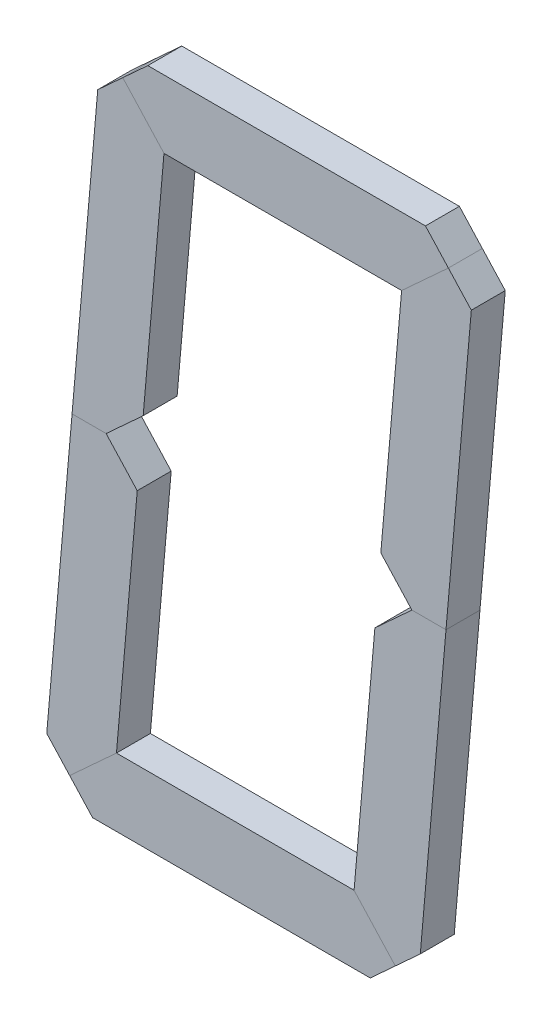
ISO-10303-21;
HEADER;
FILE_DESCRIPTION(('STEP AP214'),'2;1');
FILE_NAME('part.step','',(''),(''),'','','');
FILE_SCHEMA(('AUTOMOTIVE_DESIGN { 1 0 10303 214 1 1 1 1 }'));
ENDSEC;
DATA;
#1=APPLICATION_CONTEXT('core data for automotive mechanical design processes');
#2=APPLICATION_PROTOCOL_DEFINITION('international standard','automotive_design',2000,#1);
#3=PRODUCT_CONTEXT('',#1,'mechanical');
#4=PRODUCT('Part','Part','',(#3));
#5=PRODUCT_RELATED_PRODUCT_CATEGORY('part','',(#4));
#6=PRODUCT_DEFINITION_FORMATION('','',#4);
#7=PRODUCT_DEFINITION_CONTEXT('part definition',#1,'design');
#8=PRODUCT_DEFINITION('design','',#6,#7);
#9=PRODUCT_DEFINITION_SHAPE('','',#8);
#10=(LENGTH_UNIT() NAMED_UNIT(*) SI_UNIT(.MILLI.,.METRE.));
#11=(NAMED_UNIT(*) PLANE_ANGLE_UNIT() SI_UNIT($,.RADIAN.));
#12=(NAMED_UNIT(*) SI_UNIT($,.STERADIAN.) SOLID_ANGLE_UNIT());
#13=UNCERTAINTY_MEASURE_WITH_UNIT(LENGTH_MEASURE(1.E-05),#10,'distance_accuracy_value','');
#14=(GEOMETRIC_REPRESENTATION_CONTEXT(3) GLOBAL_UNCERTAINTY_ASSIGNED_CONTEXT((#13)) GLOBAL_UNIT_ASSIGNED_CONTEXT((#10,
#11,#12)) REPRESENTATION_CONTEXT('',''));
#15=CARTESIAN_POINT('',(0.,0.,0.));
#16=DIRECTION('',(0.,0.,1.));
#17=DIRECTION('',(1.,0.,0.));
#18=AXIS2_PLACEMENT_3D('',#15,#16,#17);
#19=CARTESIAN_POINT('',(2.78896464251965,4.63136133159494,0.));
#20=DIRECTION('',(-0.737277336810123,-0.675590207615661,0.));
#21=DIRECTION('',(0.675590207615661,-0.737277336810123,0.));
#22=AXIS2_PLACEMENT_3D('',#19,#20,#21);
#23=PLANE('',#22);
#24=DIRECTION('',(-0.675590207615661,0.737277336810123,0.));
#25=VECTOR('',#24,1.);
#26=CARTESIAN_POINT('',(2.78896464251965,4.63136133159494,-0.5));
#27=LINE('',#26,#25);
#28=CARTESIAN_POINT('',(2.78896464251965,4.63136133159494,-0.5));
#29=VERTEX_POINT('',#28);
#30=CARTESIAN_POINT('',(2.45116953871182,5.,-0.5));
#31=VERTEX_POINT('',#30);
#32=EDGE_CURVE('E128',#29,#31,#27,.T.);
#33=ORIENTED_EDGE('',*,*,#32,.T.);
#34=DIRECTION('',(0.,0.,-1.));
#35=VECTOR('',#34,1.);
#36=CARTESIAN_POINT('',(2.45116953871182,5.,0.));
#37=LINE('',#36,#35);
#38=CARTESIAN_POINT('',(2.45116953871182,5.,0.));
#39=VERTEX_POINT('',#38);
#40=EDGE_CURVE('E12',#39,#31,#37,.T.);
#41=ORIENTED_EDGE('',*,*,#40,.F.);
#42=DIRECTION('',(-0.675590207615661,0.737277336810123,0.));
#43=VECTOR('',#42,1.);
#44=CARTESIAN_POINT('',(2.78896464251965,4.63136133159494,0.));
#45=LINE('',#44,#43);
#46=CARTESIAN_POINT('',(2.78896464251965,4.63136133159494,0.));
#47=VERTEX_POINT('',#46);
#48=EDGE_CURVE('E138',#47,#39,#45,.T.);
#49=ORIENTED_EDGE('',*,*,#48,.F.);
#50=DIRECTION('',(0.,0.,-1.));
#51=VECTOR('',#50,1.);
#52=CARTESIAN_POINT('',(2.78896464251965,4.63136133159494,0.));
#53=LINE('',#52,#51);
#54=EDGE_CURVE('E124',#47,#29,#53,.T.);
#55=ORIENTED_EDGE('',*,*,#54,.T.);
#56=EDGE_LOOP('',(#33,#41,#49,#55));
#57=FACE_BOUND('',#56,.T.);
#58=ADVANCED_FACE('F44',(#57),#23,.F.);
#59=CARTESIAN_POINT('',(2.45116953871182,5.,0.));
#60=DIRECTION('',(0.,-1.,0.));
#61=DIRECTION('',(0.,0.,1.));
#62=AXIS2_PLACEMENT_3D('',#59,#60,#61);
#63=PLANE('',#62);
#64=DIRECTION('',(-1.,0.,0.));
#65=VECTOR('',#64,1.);
#66=CARTESIAN_POINT('',(2.45116953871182,5.,-0.5));
#67=LINE('',#66,#65);
#68=CARTESIAN_POINT('',(-1.63820566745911,5.,-0.5));
#69=VERTEX_POINT('',#68);
#70=EDGE_CURVE('E131',#31,#69,#67,.T.);
#71=ORIENTED_EDGE('',*,*,#70,.T.);
#72=DIRECTION('',(0.,0.,-1.));
#73=VECTOR('',#72,1.);
#74=CARTESIAN_POINT('',(-1.63820566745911,5.,0.));
#75=LINE('',#74,#73);
#76=CARTESIAN_POINT('',(-1.63820566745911,5.,0.));
#77=VERTEX_POINT('',#76);
#78=EDGE_CURVE('E52',#77,#69,#75,.T.);
#79=ORIENTED_EDGE('',*,*,#78,.F.);
#80=DIRECTION('',(-1.,0.,0.));
#81=VECTOR('',#80,1.);
#82=CARTESIAN_POINT('',(2.45116953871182,5.,0.));
#83=LINE('',#82,#81);
#84=EDGE_CURVE('E97',#39,#77,#83,.T.);
#85=ORIENTED_EDGE('',*,*,#84,.F.);
#86=ORIENTED_EDGE('',*,*,#40,.T.);
#87=EDGE_LOOP('',(#71,#79,#85,#86));
#88=FACE_BOUND('',#87,.T.);
#89=ADVANCED_FACE('F162',(#88),#63,.F.);
#90=CARTESIAN_POINT('',(-1.63820566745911,5.,0.));
#91=DIRECTION('',(0.675590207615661,-0.737277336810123,0.));
#92=DIRECTION('',(0.737277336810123,0.675590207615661,0.));
#93=AXIS2_PLACEMENT_3D('',#90,#91,#92);
#94=PLANE('',#93);
#95=DIRECTION('',(-0.737277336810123,-0.675590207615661,0.));
#96=VECTOR('',#95,1.);
#97=CARTESIAN_POINT('',(-1.63820566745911,5.,-0.5));
#98=LINE('',#97,#96);
#99=CARTESIAN_POINT('',(-2.00684433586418,4.66220489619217,-0.5));
#100=VERTEX_POINT('',#99);
#101=EDGE_CURVE('E133',#69,#100,#98,.T.);
#102=ORIENTED_EDGE('',*,*,#101,.T.);
#103=DIRECTION('',(0.,0.,-1.));
#104=VECTOR('',#103,1.);
#105=CARTESIAN_POINT('',(-2.00684433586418,4.66220489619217,0.));
#106=LINE('',#105,#104);
#107=CARTESIAN_POINT('',(-2.00684433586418,4.66220489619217,0.));
#108=VERTEX_POINT('',#107);
#109=EDGE_CURVE('E119',#108,#100,#106,.T.);
#110=ORIENTED_EDGE('',*,*,#109,.F.);
#111=DIRECTION('',(-0.737277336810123,-0.675590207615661,0.));
#112=VECTOR('',#111,1.);
#113=CARTESIAN_POINT('',(-1.63820566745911,5.,0.));
#114=LINE('',#113,#112);
#115=EDGE_CURVE('E110',#77,#108,#114,.T.);
#116=ORIENTED_EDGE('',*,*,#115,.F.);
#117=ORIENTED_EDGE('',*,*,#78,.T.);
#118=EDGE_LOOP('',(#102,#110,#116,#117));
#119=FACE_BOUND('',#118,.T.);
#120=ADVANCED_FACE('F144',(#119),#94,.F.);
#121=CARTESIAN_POINT('',(-2.00684433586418,4.66220489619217,0.));
#122=DIRECTION('',(0.737277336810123,0.675590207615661,0.));
#123=DIRECTION('',(-0.675590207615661,0.737277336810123,0.));
#124=AXIS2_PLACEMENT_3D('',#121,#122,#123);
#125=PLANE('',#124);
#126=DIRECTION('',(0.675590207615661,-0.737277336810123,0.));
#127=VECTOR('',#126,1.);
#128=CARTESIAN_POINT('',(-2.00684433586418,4.66220489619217,-0.5));
#129=LINE('',#128,#127);
#130=CARTESIAN_POINT('',(-1.40004534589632,4.,-0.5));
#131=VERTEX_POINT('',#130);
#132=EDGE_CURVE('E118',#100,#131,#129,.T.);
#133=ORIENTED_EDGE('',*,*,#132,.T.);
#134=DIRECTION('',(0.,0.,-1.));
#135=VECTOR('',#134,1.);
#136=CARTESIAN_POINT('',(-1.40004534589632,4.,0.));
#137=LINE('',#136,#135);
#138=CARTESIAN_POINT('',(-1.40004534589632,4.,0.));
#139=VERTEX_POINT('',#138);
#140=EDGE_CURVE('E115',#139,#131,#137,.T.);
#141=ORIENTED_EDGE('',*,*,#140,.F.);
#142=DIRECTION('',(0.675590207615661,-0.737277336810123,0.));
#143=VECTOR('',#142,1.);
#144=CARTESIAN_POINT('',(-2.00684433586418,4.66220489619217,0.));
#145=LINE('',#144,#143);
#146=EDGE_CURVE('E104',#108,#139,#145,.T.);
#147=ORIENTED_EDGE('',*,*,#146,.F.);
#148=ORIENTED_EDGE('',*,*,#109,.T.);
#149=EDGE_LOOP('',(#133,#141,#147,#148));
#150=FACE_BOUND('',#149,.T.);
#151=ADVANCED_FACE('F116',(#150),#125,.F.);
#152=CARTESIAN_POINT('',(-1.40004534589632,4.,0.));
#153=DIRECTION('',(0.,1.,0.));
#154=DIRECTION('',(0.,0.,-1.));
#155=AXIS2_PLACEMENT_3D('',#152,#153,#154);
#156=PLANE('',#155);
#157=DIRECTION('',(1.,0.,0.));
#158=VECTOR('',#157,1.);
#159=CARTESIAN_POINT('',(-1.40004534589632,4.,-0.5));
#160=LINE('',#159,#158);
#161=CARTESIAN_POINT('',(2.09995465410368,4.,-0.5));
#162=VERTEX_POINT('',#161);
#163=EDGE_CURVE('E83',#131,#162,#160,.T.);
#164=ORIENTED_EDGE('',*,*,#163,.T.);
#165=DIRECTION('',(0.,0.,-1.));
#166=VECTOR('',#165,1.);
#167=CARTESIAN_POINT('',(2.09995465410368,4.,0.));
#168=LINE('',#167,#166);
#169=CARTESIAN_POINT('',(2.09995465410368,4.,0.));
#170=VERTEX_POINT('',#169);
#171=EDGE_CURVE('E120',#170,#162,#168,.T.);
#172=ORIENTED_EDGE('',*,*,#171,.F.);
#173=DIRECTION('',(1.,0.,0.));
#174=VECTOR('',#173,1.);
#175=CARTESIAN_POINT('',(-1.40004534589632,4.,0.));
#176=LINE('',#175,#174);
#177=EDGE_CURVE('E108',#139,#170,#176,.T.);
#178=ORIENTED_EDGE('',*,*,#177,.F.);
#179=ORIENTED_EDGE('',*,*,#140,.T.);
#180=EDGE_LOOP('',(#164,#172,#178,#179));
#181=FACE_BOUND('',#180,.T.);
#182=ADVANCED_FACE('F122',(#181),#156,.F.);
#183=CARTESIAN_POINT('',(2.09995465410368,4.,0.));
#184=DIRECTION('',(-0.675590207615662,0.737277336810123,0.));
#185=DIRECTION('',(-0.737277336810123,-0.675590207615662,0.));
#186=AXIS2_PLACEMENT_3D('',#183,#184,#185);
#187=PLANE('',#186);
#188=DIRECTION('',(0.737277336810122,0.675590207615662,0.));
#189=VECTOR('',#188,1.);
#190=CARTESIAN_POINT('',(2.09995465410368,4.,-0.5));
#191=LINE('',#190,#189);
#192=EDGE_CURVE('E89',#162,#29,#191,.T.);
#193=ORIENTED_EDGE('',*,*,#192,.T.);
#194=ORIENTED_EDGE('',*,*,#54,.F.);
#195=DIRECTION('',(0.737277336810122,0.675590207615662,0.));
#196=VECTOR('',#195,1.);
#197=CARTESIAN_POINT('',(2.09995465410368,4.,0.));
#198=LINE('',#197,#196);
#199=EDGE_CURVE('E60',#170,#47,#198,.T.);
#200=ORIENTED_EDGE('',*,*,#199,.F.);
#201=ORIENTED_EDGE('',*,*,#171,.T.);
#202=EDGE_LOOP('',(#193,#194,#200,#201));
#203=FACE_BOUND('',#202,.T.);
#204=ADVANCED_FACE('F151',(#203),#187,.F.);
#205=CARTESIAN_POINT('',(0.,0.,0.));
#206=DIRECTION('',(0.,0.,1.));
#207=DIRECTION('',(-1.,0.,0.));
#208=AXIS2_PLACEMENT_3D('',#205,#206,#207);
#209=PLANE('',#208);
#210=ORIENTED_EDGE('',*,*,#48,.T.);
#211=ORIENTED_EDGE('',*,*,#84,.T.);
#212=ORIENTED_EDGE('',*,*,#115,.T.);
#213=ORIENTED_EDGE('',*,*,#146,.T.);
#214=ORIENTED_EDGE('',*,*,#177,.T.);
#215=ORIENTED_EDGE('',*,*,#199,.T.);
#216=EDGE_LOOP('',(#210,#211,#212,#213,#214,#215));
#217=FACE_BOUND('',#216,.T.);
#218=ADVANCED_FACE('F106',(#217),#209,.T.);
#219=CARTESIAN_POINT('',(0.,0.,-0.5));
#220=DIRECTION('',(0.,0.,1.));
#221=DIRECTION('',(-1.,0.,0.));
#222=AXIS2_PLACEMENT_3D('',#219,#220,#221);
#223=PLANE('',#222);
#224=ORIENTED_EDGE('',*,*,#32,.F.);
#225=ORIENTED_EDGE('',*,*,#192,.F.);
#226=ORIENTED_EDGE('',*,*,#163,.F.);
#227=ORIENTED_EDGE('',*,*,#132,.F.);
#228=ORIENTED_EDGE('',*,*,#101,.F.);
#229=ORIENTED_EDGE('',*,*,#70,.F.);
#230=EDGE_LOOP('',(#224,#225,#226,#227,#228,#229));
#231=FACE_BOUND('',#230,.T.);
#232=ADVANCED_FACE('F147',(#231),#223,.F.);
#233=CLOSED_SHELL('',(#58,#89,#120,#151,#182,#204,#218,#232));
#234=MANIFOLD_SOLID_BREP('B2',#233);
#235=CARTESIAN_POINT('',(2.78896464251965,4.63136133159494,0.));
#236=DIRECTION('',(-0.737277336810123,-0.675590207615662,0.));
#237=DIRECTION('',(0.675590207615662,-0.737277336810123,0.));
#238=AXIS2_PLACEMENT_3D('',#235,#236,#237);
#239=PLANE('',#238);
#240=DIRECTION('',(-0.675590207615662,0.737277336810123,0.));
#241=VECTOR('',#240,1.);
#242=CARTESIAN_POINT('',(2.78896464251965,4.63136133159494,-0.5));
#243=LINE('',#242,#241);
#244=CARTESIAN_POINT('',(3.12675974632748,4.26272266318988,-0.5));
#245=VERTEX_POINT('',#244);
#246=CARTESIAN_POINT('',(2.78896464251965,4.63136133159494,-0.5));
#247=VERTEX_POINT('',#246);
#248=EDGE_CURVE('E314',#245,#247,#243,.T.);
#249=ORIENTED_EDGE('',*,*,#248,.T.);
#250=DIRECTION('',(0.,0.,-1.));
#251=VECTOR('',#250,1.);
#252=CARTESIAN_POINT('',(2.78896464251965,4.63136133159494,0.));
#253=LINE('',#252,#251);
#254=CARTESIAN_POINT('',(2.78896464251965,4.63136133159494,0.));
#255=VERTEX_POINT('',#254);
#256=EDGE_CURVE('E42',#255,#247,#253,.T.);
#257=ORIENTED_EDGE('',*,*,#256,.F.);
#258=DIRECTION('',(-0.675590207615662,0.737277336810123,0.));
#259=VECTOR('',#258,1.);
#260=CARTESIAN_POINT('',(2.78896464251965,4.63136133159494,0.));
#261=LINE('',#260,#259);
#262=CARTESIAN_POINT('',(3.12675974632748,4.26272266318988,0.));
#263=VERTEX_POINT('',#262);
#264=EDGE_CURVE('E324',#263,#255,#261,.T.);
#265=ORIENTED_EDGE('',*,*,#264,.F.);
#266=DIRECTION('',(0.,0.,-1.));
#267=VECTOR('',#266,1.);
#268=CARTESIAN_POINT('',(3.12675974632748,4.26272266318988,0.));
#269=LINE('',#268,#267);
#270=EDGE_CURVE('E310',#263,#245,#269,.T.);
#271=ORIENTED_EDGE('',*,*,#270,.T.);
#272=EDGE_LOOP('',(#249,#257,#265,#271));
#273=FACE_BOUND('',#272,.T.);
#274=ADVANCED_FACE('F230',(#273),#239,.F.);
#275=CARTESIAN_POINT('',(2.09995465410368,4.,0.));
#276=DIRECTION('',(0.675590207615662,-0.737277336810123,0.));
#277=DIRECTION('',(0.737277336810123,0.675590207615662,0.));
#278=AXIS2_PLACEMENT_3D('',#275,#276,#277);
#279=PLANE('',#278);
#280=DIRECTION('',(-0.737277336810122,-0.675590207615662,0.));
#281=VECTOR('',#280,1.);
#282=CARTESIAN_POINT('',(2.09995465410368,4.,-0.5));
#283=LINE('',#282,#281);
#284=CARTESIAN_POINT('',(2.09995465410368,4.,-0.5));
#285=VERTEX_POINT('',#284);
#286=EDGE_CURVE('E317',#247,#285,#283,.T.);
#287=ORIENTED_EDGE('',*,*,#286,.T.);
#288=DIRECTION('',(0.,0.,-1.));
#289=VECTOR('',#288,1.);
#290=CARTESIAN_POINT('',(2.09995465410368,4.,0.));
#291=LINE('',#290,#289);
#292=CARTESIAN_POINT('',(2.09995465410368,4.,0.));
#293=VERTEX_POINT('',#292);
#294=EDGE_CURVE('E238',#293,#285,#291,.T.);
#295=ORIENTED_EDGE('',*,*,#294,.F.);
#296=DIRECTION('',(-0.737277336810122,-0.675590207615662,0.));
#297=VECTOR('',#296,1.);
#298=CARTESIAN_POINT('',(2.09995465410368,4.,0.));
#299=LINE('',#298,#297);
#300=EDGE_CURVE('E283',#255,#293,#299,.T.);
#301=ORIENTED_EDGE('',*,*,#300,.F.);
#302=ORIENTED_EDGE('',*,*,#256,.T.);
#303=EDGE_LOOP('',(#287,#295,#301,#302));
#304=FACE_BOUND('',#303,.T.);
#305=ADVANCED_FACE('F348',(#304),#279,.F.);
#306=CARTESIAN_POINT('',(1.79374433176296,0.499999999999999,0.));
#307=DIRECTION('',(0.996194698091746,-0.0871557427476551,0.));
#308=DIRECTION('',(0.0871557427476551,0.996194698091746,0.));
#309=AXIS2_PLACEMENT_3D('',#306,#307,#308);
#310=PLANE('',#309);
#311=DIRECTION('',(-0.0871557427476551,-0.996194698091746,0.));
#312=VECTOR('',#311,1.);
#313=CARTESIAN_POINT('',(1.79374433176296,0.499999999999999,-0.5));
#314=LINE('',#313,#312);
#315=CARTESIAN_POINT('',(1.79374433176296,0.499999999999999,-0.5));
#316=VERTEX_POINT('',#315);
#317=EDGE_CURVE('E319',#285,#316,#314,.T.);
#318=ORIENTED_EDGE('',*,*,#317,.T.);
#319=DIRECTION('',(0.,0.,-1.));
#320=VECTOR('',#319,1.);
#321=CARTESIAN_POINT('',(1.79374433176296,0.499999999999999,0.));
#322=LINE('',#321,#320);
#323=CARTESIAN_POINT('',(1.79374433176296,0.499999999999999,0.));
#324=VERTEX_POINT('',#323);
#325=EDGE_CURVE('E305',#324,#316,#322,.T.);
#326=ORIENTED_EDGE('',*,*,#325,.F.);
#327=DIRECTION('',(-0.0871557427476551,-0.996194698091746,0.));
#328=VECTOR('',#327,1.);
#329=CARTESIAN_POINT('',(1.79374433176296,0.499999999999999,0.));
#330=LINE('',#329,#328);
#331=EDGE_CURVE('E296',#293,#324,#330,.T.);
#332=ORIENTED_EDGE('',*,*,#331,.F.);
#333=ORIENTED_EDGE('',*,*,#294,.T.);
#334=EDGE_LOOP('',(#318,#326,#332,#333));
#335=FACE_BOUND('',#334,.T.);
#336=ADVANCED_FACE('F330',(#335),#310,.F.);
#337=CARTESIAN_POINT('',(2.25190991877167,0.,0.));
#338=DIRECTION('',(0.737277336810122,0.675590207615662,0.));
#339=DIRECTION('',(-0.675590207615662,0.737277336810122,0.));
#340=AXIS2_PLACEMENT_3D('',#337,#338,#339);
#341=PLANE('',#340);
#342=DIRECTION('',(0.675590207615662,-0.737277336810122,0.));
#343=VECTOR('',#342,1.);
#344=CARTESIAN_POINT('',(2.25190991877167,0.,-0.5));
#345=LINE('',#344,#343);
#346=CARTESIAN_POINT('',(2.25190991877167,0.,-0.5));
#347=VERTEX_POINT('',#346);
#348=EDGE_CURVE('E304',#316,#347,#345,.T.);
#349=ORIENTED_EDGE('',*,*,#348,.T.);
#350=DIRECTION('',(0.,0.,-1.));
#351=VECTOR('',#350,1.);
#352=CARTESIAN_POINT('',(2.25190991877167,0.,0.));
#353=LINE('',#352,#351);
#354=CARTESIAN_POINT('',(2.25190991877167,0.,0.));
#355=VERTEX_POINT('',#354);
#356=EDGE_CURVE('E301',#355,#347,#353,.T.);
#357=ORIENTED_EDGE('',*,*,#356,.F.);
#358=DIRECTION('',(0.675590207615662,-0.737277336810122,0.));
#359=VECTOR('',#358,1.);
#360=CARTESIAN_POINT('',(2.25190991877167,0.,0.));
#361=LINE('',#360,#359);
#362=EDGE_CURVE('E290',#324,#355,#361,.T.);
#363=ORIENTED_EDGE('',*,*,#362,.F.);
#364=ORIENTED_EDGE('',*,*,#325,.T.);
#365=EDGE_LOOP('',(#349,#357,#363,#364));
#366=FACE_BOUND('',#365,.T.);
#367=ADVANCED_FACE('F302',(#366),#341,.F.);
#368=CARTESIAN_POINT('',(2.75381983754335,0.,0.));
#369=DIRECTION('',(0.,1.,0.));
#370=DIRECTION('',(-1.,0.,0.));
#371=AXIS2_PLACEMENT_3D('',#368,#369,#370);
#372=PLANE('',#371);
#373=DIRECTION('',(1.,0.,0.));
#374=VECTOR('',#373,1.);
#375=CARTESIAN_POINT('',(2.75381983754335,0.,-0.5));
#376=LINE('',#375,#374);
#377=CARTESIAN_POINT('',(2.75381983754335,0.,-0.5));
#378=VERTEX_POINT('',#377);
#379=EDGE_CURVE('E269',#347,#378,#376,.T.);
#380=ORIENTED_EDGE('',*,*,#379,.T.);
#381=DIRECTION('',(0.,0.,-1.));
#382=VECTOR('',#381,1.);
#383=CARTESIAN_POINT('',(2.75381983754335,0.,0.));
#384=LINE('',#383,#382);
#385=CARTESIAN_POINT('',(2.75381983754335,0.,0.));
#386=VERTEX_POINT('',#385);
#387=EDGE_CURVE('E306',#386,#378,#384,.T.);
#388=ORIENTED_EDGE('',*,*,#387,.F.);
#389=DIRECTION('',(1.,0.,0.));
#390=VECTOR('',#389,1.);
#391=CARTESIAN_POINT('',(2.75381983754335,0.,0.));
#392=LINE('',#391,#390);
#393=EDGE_CURVE('E294',#355,#386,#392,.T.);
#394=ORIENTED_EDGE('',*,*,#393,.F.);
#395=ORIENTED_EDGE('',*,*,#356,.T.);
#396=EDGE_LOOP('',(#380,#388,#394,#395));
#397=FACE_BOUND('',#396,.T.);
#398=ADVANCED_FACE('F308',(#397),#372,.F.);
#399=CARTESIAN_POINT('',(3.12675974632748,4.26272266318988,0.));
#400=DIRECTION('',(-0.996194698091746,0.0871557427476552,0.));
#401=DIRECTION('',(-0.0871557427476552,-0.996194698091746,0.));
#402=AXIS2_PLACEMENT_3D('',#399,#400,#401);
#403=PLANE('',#402);
#404=DIRECTION('',(0.0871557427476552,0.996194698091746,0.));
#405=VECTOR('',#404,1.);
#406=CARTESIAN_POINT('',(3.12675974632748,4.26272266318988,-0.5));
#407=LINE('',#406,#405);
#408=EDGE_CURVE('E275',#378,#245,#407,.T.);
#409=ORIENTED_EDGE('',*,*,#408,.T.);
#410=ORIENTED_EDGE('',*,*,#270,.F.);
#411=DIRECTION('',(0.0871557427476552,0.996194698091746,0.));
#412=VECTOR('',#411,1.);
#413=CARTESIAN_POINT('',(3.12675974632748,4.26272266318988,0.));
#414=LINE('',#413,#412);
#415=EDGE_CURVE('E246',#386,#263,#414,.T.);
#416=ORIENTED_EDGE('',*,*,#415,.F.);
#417=ORIENTED_EDGE('',*,*,#387,.T.);
#418=EDGE_LOOP('',(#409,#410,#416,#417));
#419=FACE_BOUND('',#418,.T.);
#420=ADVANCED_FACE('F337',(#419),#403,.F.);
#421=CARTESIAN_POINT('',(0.,0.,0.));
#422=DIRECTION('',(0.,0.,1.));
#423=DIRECTION('',(-1.,0.,0.));
#424=AXIS2_PLACEMENT_3D('',#421,#422,#423);
#425=PLANE('',#424);
#426=ORIENTED_EDGE('',*,*,#264,.T.);
#427=ORIENTED_EDGE('',*,*,#300,.T.);
#428=ORIENTED_EDGE('',*,*,#331,.T.);
#429=ORIENTED_EDGE('',*,*,#362,.T.);
#430=ORIENTED_EDGE('',*,*,#393,.T.);
#431=ORIENTED_EDGE('',*,*,#415,.T.);
#432=EDGE_LOOP('',(#426,#427,#428,#429,#430,#431));
#433=FACE_BOUND('',#432,.T.);
#434=ADVANCED_FACE('F292',(#433),#425,.T.);
#435=CARTESIAN_POINT('',(0.,0.,-0.5));
#436=DIRECTION('',(0.,0.,1.));
#437=DIRECTION('',(-1.,0.,0.));
#438=AXIS2_PLACEMENT_3D('',#435,#436,#437);
#439=PLANE('',#438);
#440=ORIENTED_EDGE('',*,*,#248,.F.);
#441=ORIENTED_EDGE('',*,*,#408,.F.);
#442=ORIENTED_EDGE('',*,*,#379,.F.);
#443=ORIENTED_EDGE('',*,*,#348,.F.);
#444=ORIENTED_EDGE('',*,*,#317,.F.);
#445=ORIENTED_EDGE('',*,*,#286,.F.);
#446=EDGE_LOOP('',(#440,#441,#442,#443,#444,#445));
#447=FACE_BOUND('',#446,.T.);
#448=ADVANCED_FACE('F333',(#447),#439,.F.);
#449=CLOSED_SHELL('',(#274,#305,#336,#367,#398,#420,#434,#448));
#450=MANIFOLD_SOLID_BREP('B6',#449);
#451=CARTESIAN_POINT('',(-2.00684433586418,4.66220489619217,0.));
#452=DIRECTION('',(-0.737277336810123,-0.675590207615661,0.));
#453=DIRECTION('',(0.675590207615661,-0.737277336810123,0.));
#454=AXIS2_PLACEMENT_3D('',#451,#452,#453);
#455=PLANE('',#454);
#456=DIRECTION('',(-0.675590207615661,0.737277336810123,0.));
#457=VECTOR('',#456,1.);
#458=CARTESIAN_POINT('',(-2.00684433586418,4.66220489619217,-0.5));
#459=LINE('',#458,#457);
#460=CARTESIAN_POINT('',(-1.40004534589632,4.,-0.5));
#461=VERTEX_POINT('',#460);
#462=CARTESIAN_POINT('',(-2.00684433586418,4.66220489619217,-0.5));
#463=VERTEX_POINT('',#462);
#464=EDGE_CURVE('E500',#461,#463,#459,.T.);
#465=ORIENTED_EDGE('',*,*,#464,.T.);
#466=DIRECTION('',(0.,0.,-1.));
#467=VECTOR('',#466,1.);
#468=CARTESIAN_POINT('',(-2.00684433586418,4.66220489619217,0.));
#469=LINE('',#468,#467);
#470=CARTESIAN_POINT('',(-2.00684433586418,4.66220489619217,0.));
#471=VERTEX_POINT('',#470);
#472=EDGE_CURVE('E228',#471,#463,#469,.T.);
#473=ORIENTED_EDGE('',*,*,#472,.F.);
#474=DIRECTION('',(-0.675590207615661,0.737277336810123,0.));
#475=VECTOR('',#474,1.);
#476=CARTESIAN_POINT('',(-2.00684433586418,4.66220489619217,0.));
#477=LINE('',#476,#475);
#478=CARTESIAN_POINT('',(-1.40004534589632,4.,0.));
#479=VERTEX_POINT('',#478);
#480=EDGE_CURVE('E510',#479,#471,#477,.T.);
#481=ORIENTED_EDGE('',*,*,#480,.F.);
#482=DIRECTION('',(0.,0.,-1.));
#483=VECTOR('',#482,1.);
#484=CARTESIAN_POINT('',(-1.40004534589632,4.,0.));
#485=LINE('',#484,#483);
#486=EDGE_CURVE('E496',#479,#461,#485,.T.);
#487=ORIENTED_EDGE('',*,*,#486,.T.);
#488=EDGE_LOOP('',(#465,#473,#481,#487));
#489=FACE_BOUND('',#488,.T.);
#490=ADVANCED_FACE('F416',(#489),#455,.F.);
#491=CARTESIAN_POINT('',(-2.37548300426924,4.32440979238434,0.));
#492=DIRECTION('',(0.675590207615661,-0.737277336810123,0.));
#493=DIRECTION('',(0.737277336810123,0.675590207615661,0.));
#494=AXIS2_PLACEMENT_3D('',#491,#492,#493);
#495=PLANE('',#494);
#496=DIRECTION('',(-0.737277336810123,-0.675590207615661,0.));
#497=VECTOR('',#496,1.);
#498=CARTESIAN_POINT('',(-2.37548300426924,4.32440979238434,-0.5));
#499=LINE('',#498,#497);
#500=CARTESIAN_POINT('',(-2.37548300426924,4.32440979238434,-0.5));
#501=VERTEX_POINT('',#500);
#502=EDGE_CURVE('E503',#463,#501,#499,.T.);
#503=ORIENTED_EDGE('',*,*,#502,.T.);
#504=DIRECTION('',(0.,0.,-1.));
#505=VECTOR('',#504,1.);
#506=CARTESIAN_POINT('',(-2.37548300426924,4.32440979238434,0.));
#507=LINE('',#506,#505);
#508=CARTESIAN_POINT('',(-2.37548300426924,4.32440979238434,0.));
#509=VERTEX_POINT('',#508);
#510=EDGE_CURVE('E424',#509,#501,#507,.T.);
#511=ORIENTED_EDGE('',*,*,#510,.F.);
#512=DIRECTION('',(-0.737277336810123,-0.675590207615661,0.));
#513=VECTOR('',#512,1.);
#514=CARTESIAN_POINT('',(-2.37548300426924,4.32440979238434,0.));
#515=LINE('',#514,#513);
#516=EDGE_CURVE('E469',#471,#509,#515,.T.);
#517=ORIENTED_EDGE('',*,*,#516,.F.);
#518=ORIENTED_EDGE('',*,*,#472,.T.);
#519=EDGE_LOOP('',(#503,#511,#517,#518));
#520=FACE_BOUND('',#519,.T.);
#521=ADVANCED_FACE('F534',(#520),#495,.F.);
#522=CARTESIAN_POINT('',(-2.75381983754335,0.,0.));
#523=DIRECTION('',(0.996194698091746,-0.087155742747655,0.));
#524=DIRECTION('',(0.087155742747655,0.996194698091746,0.));
#525=AXIS2_PLACEMENT_3D('',#522,#523,#524);
#526=PLANE('',#525);
#527=DIRECTION('',(-0.087155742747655,-0.996194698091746,0.));
#528=VECTOR('',#527,1.);
#529=CARTESIAN_POINT('',(-2.75381983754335,0.,-0.5));
#530=LINE('',#529,#528);
#531=CARTESIAN_POINT('',(-2.75381983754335,0.,-0.5));
#532=VERTEX_POINT('',#531);
#533=EDGE_CURVE('E505',#501,#532,#530,.T.);
#534=ORIENTED_EDGE('',*,*,#533,.T.);
#535=DIRECTION('',(0.,0.,-1.));
#536=VECTOR('',#535,1.);
#537=CARTESIAN_POINT('',(-2.75381983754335,0.,0.));
#538=LINE('',#537,#536);
#539=CARTESIAN_POINT('',(-2.75381983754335,0.,0.));
#540=VERTEX_POINT('',#539);
#541=EDGE_CURVE('E491',#540,#532,#538,.T.);
#542=ORIENTED_EDGE('',*,*,#541,.F.);
#543=DIRECTION('',(-0.087155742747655,-0.996194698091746,0.));
#544=VECTOR('',#543,1.);
#545=CARTESIAN_POINT('',(-2.75381983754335,0.,0.));
#546=LINE('',#545,#544);
#547=EDGE_CURVE('E482',#509,#540,#546,.T.);
#548=ORIENTED_EDGE('',*,*,#547,.F.);
#549=ORIENTED_EDGE('',*,*,#510,.T.);
#550=EDGE_LOOP('',(#534,#542,#548,#549));
#551=FACE_BOUND('',#550,.T.);
#552=ADVANCED_FACE('F516',(#551),#526,.F.);
#553=CARTESIAN_POINT('',(-2.25190991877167,0.,0.));
#554=DIRECTION('',(0.,1.,0.));
#555=DIRECTION('',(-1.,0.,0.));
#556=AXIS2_PLACEMENT_3D('',#553,#554,#555);
#557=PLANE('',#556);
#558=DIRECTION('',(1.,0.,0.));
#559=VECTOR('',#558,1.);
#560=CARTESIAN_POINT('',(-2.25190991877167,0.,-0.5));
#561=LINE('',#560,#559);
#562=CARTESIAN_POINT('',(-2.25190991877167,0.,-0.5));
#563=VERTEX_POINT('',#562);
#564=EDGE_CURVE('E490',#532,#563,#561,.T.);
#565=ORIENTED_EDGE('',*,*,#564,.T.);
#566=DIRECTION('',(0.,0.,-1.));
#567=VECTOR('',#566,1.);
#568=CARTESIAN_POINT('',(-2.25190991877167,0.,0.));
#569=LINE('',#568,#567);
#570=CARTESIAN_POINT('',(-2.25190991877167,0.,0.));
#571=VERTEX_POINT('',#570);
#572=EDGE_CURVE('E487',#571,#563,#569,.T.);
#573=ORIENTED_EDGE('',*,*,#572,.F.);
#574=DIRECTION('',(1.,0.,0.));
#575=VECTOR('',#574,1.);
#576=CARTESIAN_POINT('',(-2.25190991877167,0.,0.));
#577=LINE('',#576,#575);
#578=EDGE_CURVE('E476',#540,#571,#577,.T.);
#579=ORIENTED_EDGE('',*,*,#578,.F.);
#580=ORIENTED_EDGE('',*,*,#541,.T.);
#581=EDGE_LOOP('',(#565,#573,#579,#580));
#582=FACE_BOUND('',#581,.T.);
#583=ADVANCED_FACE('F488',(#582),#557,.F.);
#584=CARTESIAN_POINT('',(-1.70625566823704,0.499999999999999,0.));
#585=DIRECTION('',(-0.675590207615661,0.737277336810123,0.));
#586=DIRECTION('',(-0.737277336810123,-0.675590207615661,0.));
#587=AXIS2_PLACEMENT_3D('',#584,#585,#586);
#588=PLANE('',#587);
#589=DIRECTION('',(0.737277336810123,0.675590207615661,0.));
#590=VECTOR('',#589,1.);
#591=CARTESIAN_POINT('',(-1.70625566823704,0.499999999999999,-0.5));
#592=LINE('',#591,#590);
#593=CARTESIAN_POINT('',(-1.70625566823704,0.499999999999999,-0.5));
#594=VERTEX_POINT('',#593);
#595=EDGE_CURVE('E455',#563,#594,#592,.T.);
#596=ORIENTED_EDGE('',*,*,#595,.T.);
#597=DIRECTION('',(0.,0.,-1.));
#598=VECTOR('',#597,1.);
#599=CARTESIAN_POINT('',(-1.70625566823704,0.499999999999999,0.));
#600=LINE('',#599,#598);
#601=CARTESIAN_POINT('',(-1.70625566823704,0.499999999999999,0.));
#602=VERTEX_POINT('',#601);
#603=EDGE_CURVE('E492',#602,#594,#600,.T.);
#604=ORIENTED_EDGE('',*,*,#603,.F.);
#605=DIRECTION('',(0.737277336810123,0.675590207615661,0.));
#606=VECTOR('',#605,1.);
#607=CARTESIAN_POINT('',(-1.70625566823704,0.499999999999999,0.));
#608=LINE('',#607,#606);
#609=EDGE_CURVE('E480',#571,#602,#608,.T.);
#610=ORIENTED_EDGE('',*,*,#609,.F.);
#611=ORIENTED_EDGE('',*,*,#572,.T.);
#612=EDGE_LOOP('',(#596,#604,#610,#611));
#613=FACE_BOUND('',#612,.T.);
#614=ADVANCED_FACE('F494',(#613),#588,.F.);
#615=CARTESIAN_POINT('',(-1.40004534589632,4.,0.));
#616=DIRECTION('',(-0.996194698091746,0.0871557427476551,0.));
#617=DIRECTION('',(-0.0871557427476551,-0.996194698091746,0.));
#618=AXIS2_PLACEMENT_3D('',#615,#616,#617);
#619=PLANE('',#618);
#620=DIRECTION('',(0.0871557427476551,0.996194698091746,0.));
#621=VECTOR('',#620,1.);
#622=CARTESIAN_POINT('',(-1.40004534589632,4.,-0.5));
#623=LINE('',#622,#621);
#624=EDGE_CURVE('E461',#594,#461,#623,.T.);
#625=ORIENTED_EDGE('',*,*,#624,.T.);
#626=ORIENTED_EDGE('',*,*,#486,.F.);
#627=DIRECTION('',(0.0871557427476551,0.996194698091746,0.));
#628=VECTOR('',#627,1.);
#629=CARTESIAN_POINT('',(-1.40004534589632,4.,0.));
#630=LINE('',#629,#628);
#631=EDGE_CURVE('E432',#602,#479,#630,.T.);
#632=ORIENTED_EDGE('',*,*,#631,.F.);
#633=ORIENTED_EDGE('',*,*,#603,.T.);
#634=EDGE_LOOP('',(#625,#626,#632,#633));
#635=FACE_BOUND('',#634,.T.);
#636=ADVANCED_FACE('F523',(#635),#619,.F.);
#637=CARTESIAN_POINT('',(0.,0.,0.));
#638=DIRECTION('',(0.,0.,-1.));
#639=DIRECTION('',(1.,0.,0.));
#640=AXIS2_PLACEMENT_3D('',#637,#638,#639);
#641=PLANE('',#640);
#642=ORIENTED_EDGE('',*,*,#480,.T.);
#643=ORIENTED_EDGE('',*,*,#516,.T.);
#644=ORIENTED_EDGE('',*,*,#547,.T.);
#645=ORIENTED_EDGE('',*,*,#578,.T.);
#646=ORIENTED_EDGE('',*,*,#609,.T.);
#647=ORIENTED_EDGE('',*,*,#631,.T.);
#648=EDGE_LOOP('',(#642,#643,#644,#645,#646,#647));
#649=FACE_BOUND('',#648,.T.);
#650=ADVANCED_FACE('F478',(#649),#641,.F.);
#651=CARTESIAN_POINT('',(0.,0.,-0.5));
#652=DIRECTION('',(0.,0.,-1.));
#653=DIRECTION('',(1.,0.,0.));
#654=AXIS2_PLACEMENT_3D('',#651,#652,#653);
#655=PLANE('',#654);
#656=ORIENTED_EDGE('',*,*,#464,.F.);
#657=ORIENTED_EDGE('',*,*,#624,.F.);
#658=ORIENTED_EDGE('',*,*,#595,.F.);
#659=ORIENTED_EDGE('',*,*,#564,.F.);
#660=ORIENTED_EDGE('',*,*,#533,.F.);
#661=ORIENTED_EDGE('',*,*,#502,.F.);
#662=EDGE_LOOP('',(#656,#657,#658,#659,#660,#661));
#663=FACE_BOUND('',#662,.T.);
#664=ADVANCED_FACE('F519',(#663),#655,.T.);
#665=CLOSED_SHELL('',(#490,#521,#552,#583,#614,#636,#650,#664));
#666=MANIFOLD_SOLID_BREP('B36',#665);
#667=CARTESIAN_POINT('',(2.00684433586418,-4.66220489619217,0.));
#668=DIRECTION('',(0.737277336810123,0.675590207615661,0.));
#669=DIRECTION('',(-0.675590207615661,0.737277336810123,0.));
#670=AXIS2_PLACEMENT_3D('',#667,#668,#669);
#671=PLANE('',#670);
#672=DIRECTION('',(0.675590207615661,-0.737277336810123,0.));
#673=VECTOR('',#672,1.);
#674=CARTESIAN_POINT('',(2.00684433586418,-4.66220489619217,-0.5));
#675=LINE('',#674,#673);
#676=CARTESIAN_POINT('',(1.40004534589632,-4.,-0.5));
#677=VERTEX_POINT('',#676);
#678=CARTESIAN_POINT('',(2.00684433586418,-4.66220489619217,-0.5));
#679=VERTEX_POINT('',#678);
#680=EDGE_CURVE('E686',#677,#679,#675,.T.);
#681=ORIENTED_EDGE('',*,*,#680,.T.);
#682=DIRECTION('',(0.,0.,-1.));
#683=VECTOR('',#682,1.);
#684=CARTESIAN_POINT('',(2.00684433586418,-4.66220489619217,0.));
#685=LINE('',#684,#683);
#686=CARTESIAN_POINT('',(2.00684433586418,-4.66220489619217,0.));
#687=VERTEX_POINT('',#686);
#688=EDGE_CURVE('E414',#687,#679,#685,.T.);
#689=ORIENTED_EDGE('',*,*,#688,.F.);
#690=DIRECTION('',(0.675590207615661,-0.737277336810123,0.));
#691=VECTOR('',#690,1.);
#692=CARTESIAN_POINT('',(2.00684433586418,-4.66220489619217,0.));
#693=LINE('',#692,#691);
#694=CARTESIAN_POINT('',(1.40004534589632,-4.,0.));
#695=VERTEX_POINT('',#694);
#696=EDGE_CURVE('E696',#695,#687,#693,.T.);
#697=ORIENTED_EDGE('',*,*,#696,.F.);
#698=DIRECTION('',(0.,0.,-1.));
#699=VECTOR('',#698,1.);
#700=CARTESIAN_POINT('',(1.40004534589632,-4.,0.));
#701=LINE('',#700,#699);
#702=EDGE_CURVE('E682',#695,#677,#701,.T.);
#703=ORIENTED_EDGE('',*,*,#702,.T.);
#704=EDGE_LOOP('',(#681,#689,#697,#703));
#705=FACE_BOUND('',#704,.T.);
#706=ADVANCED_FACE('F602',(#705),#671,.F.);
#707=CARTESIAN_POINT('',(2.37548300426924,-4.32440979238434,0.));
#708=DIRECTION('',(-0.675590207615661,0.737277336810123,0.));
#709=DIRECTION('',(-0.737277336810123,-0.675590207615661,0.));
#710=AXIS2_PLACEMENT_3D('',#707,#708,#709);
#711=PLANE('',#710);
#712=DIRECTION('',(0.737277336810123,0.675590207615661,0.));
#713=VECTOR('',#712,1.);
#714=CARTESIAN_POINT('',(2.37548300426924,-4.32440979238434,-0.5));
#715=LINE('',#714,#713);
#716=CARTESIAN_POINT('',(2.37548300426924,-4.32440979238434,-0.5));
#717=VERTEX_POINT('',#716);
#718=EDGE_CURVE('E689',#679,#717,#715,.T.);
#719=ORIENTED_EDGE('',*,*,#718,.T.);
#720=DIRECTION('',(0.,0.,-1.));
#721=VECTOR('',#720,1.);
#722=CARTESIAN_POINT('',(2.37548300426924,-4.32440979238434,0.));
#723=LINE('',#722,#721);
#724=CARTESIAN_POINT('',(2.37548300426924,-4.32440979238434,0.));
#725=VERTEX_POINT('',#724);
#726=EDGE_CURVE('E610',#725,#717,#723,.T.);
#727=ORIENTED_EDGE('',*,*,#726,.F.);
#728=DIRECTION('',(0.737277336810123,0.675590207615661,0.));
#729=VECTOR('',#728,1.);
#730=CARTESIAN_POINT('',(2.37548300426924,-4.32440979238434,0.));
#731=LINE('',#730,#729);
#732=EDGE_CURVE('E655',#687,#725,#731,.T.);
#733=ORIENTED_EDGE('',*,*,#732,.F.);
#734=ORIENTED_EDGE('',*,*,#688,.T.);
#735=EDGE_LOOP('',(#719,#727,#733,#734));
#736=FACE_BOUND('',#735,.T.);
#737=ADVANCED_FACE('F720',(#736),#711,.F.);
#738=CARTESIAN_POINT('',(2.75381983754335,0.,0.));
#739=DIRECTION('',(-0.996194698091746,0.087155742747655,0.));
#740=DIRECTION('',(-0.087155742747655,-0.996194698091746,0.));
#741=AXIS2_PLACEMENT_3D('',#738,#739,#740);
#742=PLANE('',#741);
#743=DIRECTION('',(0.087155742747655,0.996194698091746,0.));
#744=VECTOR('',#743,1.);
#745=CARTESIAN_POINT('',(2.75381983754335,0.,-0.5));
#746=LINE('',#745,#744);
#747=CARTESIAN_POINT('',(2.75381983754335,0.,-0.5));
#748=VERTEX_POINT('',#747);
#749=EDGE_CURVE('E691',#717,#748,#746,.T.);
#750=ORIENTED_EDGE('',*,*,#749,.T.);
#751=DIRECTION('',(0.,0.,-1.));
#752=VECTOR('',#751,1.);
#753=CARTESIAN_POINT('',(2.75381983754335,0.,0.));
#754=LINE('',#753,#752);
#755=CARTESIAN_POINT('',(2.75381983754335,0.,0.));
#756=VERTEX_POINT('',#755);
#757=EDGE_CURVE('E677',#756,#748,#754,.T.);
#758=ORIENTED_EDGE('',*,*,#757,.F.);
#759=DIRECTION('',(0.087155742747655,0.996194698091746,0.));
#760=VECTOR('',#759,1.);
#761=CARTESIAN_POINT('',(2.75381983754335,0.,0.));
#762=LINE('',#761,#760);
#763=EDGE_CURVE('E668',#725,#756,#762,.T.);
#764=ORIENTED_EDGE('',*,*,#763,.F.);
#765=ORIENTED_EDGE('',*,*,#726,.T.);
#766=EDGE_LOOP('',(#750,#758,#764,#765));
#767=FACE_BOUND('',#766,.T.);
#768=ADVANCED_FACE('F702',(#767),#742,.F.);
#769=CARTESIAN_POINT('',(2.25190991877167,0.,0.));
#770=DIRECTION('',(0.,-1.,0.));
#771=DIRECTION('',(1.,0.,0.));
#772=AXIS2_PLACEMENT_3D('',#769,#770,#771);
#773=PLANE('',#772);
#774=DIRECTION('',(-1.,0.,0.));
#775=VECTOR('',#774,1.);
#776=CARTESIAN_POINT('',(2.25190991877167,0.,-0.5));
#777=LINE('',#776,#775);
#778=CARTESIAN_POINT('',(2.25190991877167,0.,-0.5));
#779=VERTEX_POINT('',#778);
#780=EDGE_CURVE('E676',#748,#779,#777,.T.);
#781=ORIENTED_EDGE('',*,*,#780,.T.);
#782=DIRECTION('',(0.,0.,-1.));
#783=VECTOR('',#782,1.);
#784=CARTESIAN_POINT('',(2.25190991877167,0.,0.));
#785=LINE('',#784,#783);
#786=CARTESIAN_POINT('',(2.25190991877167,0.,0.));
#787=VERTEX_POINT('',#786);
#788=EDGE_CURVE('E673',#787,#779,#785,.T.);
#789=ORIENTED_EDGE('',*,*,#788,.F.);
#790=DIRECTION('',(-1.,0.,0.));
#791=VECTOR('',#790,1.);
#792=CARTESIAN_POINT('',(2.25190991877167,0.,0.));
#793=LINE('',#792,#791);
#794=EDGE_CURVE('E662',#756,#787,#793,.T.);
#795=ORIENTED_EDGE('',*,*,#794,.F.);
#796=ORIENTED_EDGE('',*,*,#757,.T.);
#797=EDGE_LOOP('',(#781,#789,#795,#796));
#798=FACE_BOUND('',#797,.T.);
#799=ADVANCED_FACE('F674',(#798),#773,.F.);
#800=CARTESIAN_POINT('',(1.70625566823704,-0.499999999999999,0.));
#801=DIRECTION('',(0.675590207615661,-0.737277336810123,0.));
#802=DIRECTION('',(0.737277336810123,0.675590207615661,0.));
#803=AXIS2_PLACEMENT_3D('',#800,#801,#802);
#804=PLANE('',#803);
#805=DIRECTION('',(-0.737277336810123,-0.675590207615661,0.));
#806=VECTOR('',#805,1.);
#807=CARTESIAN_POINT('',(1.70625566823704,-0.499999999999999,-0.5));
#808=LINE('',#807,#806);
#809=CARTESIAN_POINT('',(1.70625566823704,-0.499999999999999,-0.5));
#810=VERTEX_POINT('',#809);
#811=EDGE_CURVE('E641',#779,#810,#808,.T.);
#812=ORIENTED_EDGE('',*,*,#811,.T.);
#813=DIRECTION('',(0.,0.,-1.));
#814=VECTOR('',#813,1.);
#815=CARTESIAN_POINT('',(1.70625566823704,-0.499999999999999,0.));
#816=LINE('',#815,#814);
#817=CARTESIAN_POINT('',(1.70625566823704,-0.499999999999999,0.));
#818=VERTEX_POINT('',#817);
#819=EDGE_CURVE('E678',#818,#810,#816,.T.);
#820=ORIENTED_EDGE('',*,*,#819,.F.);
#821=DIRECTION('',(-0.737277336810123,-0.675590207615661,0.));
#822=VECTOR('',#821,1.);
#823=CARTESIAN_POINT('',(1.70625566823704,-0.499999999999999,0.));
#824=LINE('',#823,#822);
#825=EDGE_CURVE('E666',#787,#818,#824,.T.);
#826=ORIENTED_EDGE('',*,*,#825,.F.);
#827=ORIENTED_EDGE('',*,*,#788,.T.);
#828=EDGE_LOOP('',(#812,#820,#826,#827));
#829=FACE_BOUND('',#828,.T.);
#830=ADVANCED_FACE('F680',(#829),#804,.F.);
#831=CARTESIAN_POINT('',(1.40004534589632,-4.,0.));
#832=DIRECTION('',(0.996194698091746,-0.0871557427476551,0.));
#833=DIRECTION('',(0.0871557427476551,0.996194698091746,0.));
#834=AXIS2_PLACEMENT_3D('',#831,#832,#833);
#835=PLANE('',#834);
#836=DIRECTION('',(-0.0871557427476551,-0.996194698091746,0.));
#837=VECTOR('',#836,1.);
#838=CARTESIAN_POINT('',(1.40004534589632,-4.,-0.5));
#839=LINE('',#838,#837);
#840=EDGE_CURVE('E647',#810,#677,#839,.T.);
#841=ORIENTED_EDGE('',*,*,#840,.T.);
#842=ORIENTED_EDGE('',*,*,#702,.F.);
#843=DIRECTION('',(-0.0871557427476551,-0.996194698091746,0.));
#844=VECTOR('',#843,1.);
#845=CARTESIAN_POINT('',(1.40004534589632,-4.,0.));
#846=LINE('',#845,#844);
#847=EDGE_CURVE('E618',#818,#695,#846,.T.);
#848=ORIENTED_EDGE('',*,*,#847,.F.);
#849=ORIENTED_EDGE('',*,*,#819,.T.);
#850=EDGE_LOOP('',(#841,#842,#848,#849));
#851=FACE_BOUND('',#850,.T.);
#852=ADVANCED_FACE('F709',(#851),#835,.F.);
#853=CARTESIAN_POINT('',(0.,0.,0.));
#854=DIRECTION('',(0.,0.,-1.));
#855=DIRECTION('',(-1.,0.,0.));
#856=AXIS2_PLACEMENT_3D('',#853,#854,#855);
#857=PLANE('',#856);
#858=ORIENTED_EDGE('',*,*,#696,.T.);
#859=ORIENTED_EDGE('',*,*,#732,.T.);
#860=ORIENTED_EDGE('',*,*,#763,.T.);
#861=ORIENTED_EDGE('',*,*,#794,.T.);
#862=ORIENTED_EDGE('',*,*,#825,.T.);
#863=ORIENTED_EDGE('',*,*,#847,.T.);
#864=EDGE_LOOP('',(#858,#859,#860,#861,#862,#863));
#865=FACE_BOUND('',#864,.T.);
#866=ADVANCED_FACE('F664',(#865),#857,.F.);
#867=CARTESIAN_POINT('',(0.,0.,-0.5));
#868=DIRECTION('',(0.,0.,-1.));
#869=DIRECTION('',(-1.,0.,0.));
#870=AXIS2_PLACEMENT_3D('',#867,#868,#869);
#871=PLANE('',#870);
#872=ORIENTED_EDGE('',*,*,#680,.F.);
#873=ORIENTED_EDGE('',*,*,#840,.F.);
#874=ORIENTED_EDGE('',*,*,#811,.F.);
#875=ORIENTED_EDGE('',*,*,#780,.F.);
#876=ORIENTED_EDGE('',*,*,#749,.F.);
#877=ORIENTED_EDGE('',*,*,#718,.F.);
#878=EDGE_LOOP('',(#872,#873,#874,#875,#876,#877));
#879=FACE_BOUND('',#878,.T.);
#880=ADVANCED_FACE('F705',(#879),#871,.T.);
#881=CLOSED_SHELL('',(#706,#737,#768,#799,#830,#852,#866,#880));
#882=MANIFOLD_SOLID_BREP('B222',#881);
#883=CARTESIAN_POINT('',(-2.78896464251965,-4.63136133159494,0.));
#884=DIRECTION('',(0.737277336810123,0.675590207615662,0.));
#885=DIRECTION('',(-0.675590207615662,0.737277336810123,0.));
#886=AXIS2_PLACEMENT_3D('',#883,#884,#885);
#887=PLANE('',#886);
#888=DIRECTION('',(0.675590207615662,-0.737277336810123,0.));
#889=VECTOR('',#888,1.);
#890=CARTESIAN_POINT('',(-2.78896464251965,-4.63136133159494,-0.5));
#891=LINE('',#890,#889);
#892=CARTESIAN_POINT('',(-3.12675974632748,-4.26272266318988,-0.5));
#893=VERTEX_POINT('',#892);
#894=CARTESIAN_POINT('',(-2.78896464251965,-4.63136133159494,-0.5));
#895=VERTEX_POINT('',#894);
#896=EDGE_CURVE('E871',#893,#895,#891,.T.);
#897=ORIENTED_EDGE('',*,*,#896,.T.);
#898=DIRECTION('',(0.,0.,-1.));
#899=VECTOR('',#898,1.);
#900=CARTESIAN_POINT('',(-2.78896464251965,-4.63136133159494,0.));
#901=LINE('',#900,#899);
#902=CARTESIAN_POINT('',(-2.78896464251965,-4.63136133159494,0.));
#903=VERTEX_POINT('',#902);
#904=EDGE_CURVE('E600',#903,#895,#901,.T.);
#905=ORIENTED_EDGE('',*,*,#904,.F.);
#906=DIRECTION('',(0.675590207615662,-0.737277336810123,0.));
#907=VECTOR('',#906,1.);
#908=CARTESIAN_POINT('',(-2.78896464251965,-4.63136133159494,0.));
#909=LINE('',#908,#907);
#910=CARTESIAN_POINT('',(-3.12675974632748,-4.26272266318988,0.));
#911=VERTEX_POINT('',#910);
#912=EDGE_CURVE('E881',#911,#903,#909,.T.);
#913=ORIENTED_EDGE('',*,*,#912,.F.);
#914=DIRECTION('',(0.,0.,-1.));
#915=VECTOR('',#914,1.);
#916=CARTESIAN_POINT('',(-3.12675974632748,-4.26272266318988,0.));
#917=LINE('',#916,#915);
#918=EDGE_CURVE('E867',#911,#893,#917,.T.);
#919=ORIENTED_EDGE('',*,*,#918,.T.);
#920=EDGE_LOOP('',(#897,#905,#913,#919));
#921=FACE_BOUND('',#920,.T.);
#922=ADVANCED_FACE('F787',(#921),#887,.F.);
#923=CARTESIAN_POINT('',(-2.09995465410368,-4.,0.));
#924=DIRECTION('',(-0.675590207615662,0.737277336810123,0.));
#925=DIRECTION('',(-0.737277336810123,-0.675590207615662,0.));
#926=AXIS2_PLACEMENT_3D('',#923,#924,#925);
#927=PLANE('',#926);
#928=DIRECTION('',(0.737277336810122,0.675590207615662,0.));
#929=VECTOR('',#928,1.);
#930=CARTESIAN_POINT('',(-2.09995465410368,-4.,-0.5));
#931=LINE('',#930,#929);
#932=CARTESIAN_POINT('',(-2.09995465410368,-4.,-0.5));
#933=VERTEX_POINT('',#932);
#934=EDGE_CURVE('E874',#895,#933,#931,.T.);
#935=ORIENTED_EDGE('',*,*,#934,.T.);
#936=DIRECTION('',(0.,0.,-1.));
#937=VECTOR('',#936,1.);
#938=CARTESIAN_POINT('',(-2.09995465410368,-4.,0.));
#939=LINE('',#938,#937);
#940=CARTESIAN_POINT('',(-2.09995465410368,-4.,0.));
#941=VERTEX_POINT('',#940);
#942=EDGE_CURVE('E795',#941,#933,#939,.T.);
#943=ORIENTED_EDGE('',*,*,#942,.F.);
#944=DIRECTION('',(0.737277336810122,0.675590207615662,0.));
#945=VECTOR('',#944,1.);
#946=CARTESIAN_POINT('',(-2.09995465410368,-4.,0.));
#947=LINE('',#946,#945);
#948=EDGE_CURVE('E840',#903,#941,#947,.T.);
#949=ORIENTED_EDGE('',*,*,#948,.F.);
#950=ORIENTED_EDGE('',*,*,#904,.T.);
#951=EDGE_LOOP('',(#935,#943,#949,#950));
#952=FACE_BOUND('',#951,.T.);
#953=ADVANCED_FACE('F905',(#952),#927,.F.);
#954=CARTESIAN_POINT('',(-1.79374433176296,-0.499999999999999,0.));
#955=DIRECTION('',(-0.996194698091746,0.0871557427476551,0.));
#956=DIRECTION('',(-0.0871557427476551,-0.996194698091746,0.));
#957=AXIS2_PLACEMENT_3D('',#954,#955,#956);
#958=PLANE('',#957);
#959=DIRECTION('',(0.0871557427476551,0.996194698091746,0.));
#960=VECTOR('',#959,1.);
#961=CARTESIAN_POINT('',(-1.79374433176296,-0.499999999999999,-0.5));
#962=LINE('',#961,#960);
#963=CARTESIAN_POINT('',(-1.79374433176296,-0.499999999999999,-0.5));
#964=VERTEX_POINT('',#963);
#965=EDGE_CURVE('E876',#933,#964,#962,.T.);
#966=ORIENTED_EDGE('',*,*,#965,.T.);
#967=DIRECTION('',(0.,0.,-1.));
#968=VECTOR('',#967,1.);
#969=CARTESIAN_POINT('',(-1.79374433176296,-0.499999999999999,0.));
#970=LINE('',#969,#968);
#971=CARTESIAN_POINT('',(-1.79374433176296,-0.499999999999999,0.));
#972=VERTEX_POINT('',#971);
#973=EDGE_CURVE('E862',#972,#964,#970,.T.);
#974=ORIENTED_EDGE('',*,*,#973,.F.);
#975=DIRECTION('',(0.0871557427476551,0.996194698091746,0.));
#976=VECTOR('',#975,1.);
#977=CARTESIAN_POINT('',(-1.79374433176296,-0.499999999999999,0.));
#978=LINE('',#977,#976);
#979=EDGE_CURVE('E853',#941,#972,#978,.T.);
#980=ORIENTED_EDGE('',*,*,#979,.F.);
#981=ORIENTED_EDGE('',*,*,#942,.T.);
#982=EDGE_LOOP('',(#966,#974,#980,#981));
#983=FACE_BOUND('',#982,.T.);
#984=ADVANCED_FACE('F887',(#983),#958,.F.);
#985=CARTESIAN_POINT('',(-2.25190991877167,0.,0.));
#986=DIRECTION('',(-0.737277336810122,-0.675590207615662,0.));
#987=DIRECTION('',(0.675590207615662,-0.737277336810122,0.));
#988=AXIS2_PLACEMENT_3D('',#985,#986,#987);
#989=PLANE('',#988);
#990=DIRECTION('',(-0.675590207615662,0.737277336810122,0.));
#991=VECTOR('',#990,1.);
#992=CARTESIAN_POINT('',(-2.25190991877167,0.,-0.5));
#993=LINE('',#992,#991);
#994=CARTESIAN_POINT('',(-2.25190991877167,0.,-0.5));
#995=VERTEX_POINT('',#994);
#996=EDGE_CURVE('E861',#964,#995,#993,.T.);
#997=ORIENTED_EDGE('',*,*,#996,.T.);
#998=DIRECTION('',(0.,0.,-1.));
#999=VECTOR('',#998,1.);
#1000=CARTESIAN_POINT('',(-2.25190991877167,0.,0.));
#1001=LINE('',#1000,#999);
#1002=CARTESIAN_POINT('',(-2.25190991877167,0.,0.));
#1003=VERTEX_POINT('',#1002);
#1004=EDGE_CURVE('E858',#1003,#995,#1001,.T.);
#1005=ORIENTED_EDGE('',*,*,#1004,.F.);
#1006=DIRECTION('',(-0.675590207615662,0.737277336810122,0.));
#1007=VECTOR('',#1006,1.);
#1008=CARTESIAN_POINT('',(-2.25190991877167,0.,0.));
#1009=LINE('',#1008,#1007);
#1010=EDGE_CURVE('E847',#972,#1003,#1009,.T.);
#1011=ORIENTED_EDGE('',*,*,#1010,.F.);
#1012=ORIENTED_EDGE('',*,*,#973,.T.);
#1013=EDGE_LOOP('',(#997,#1005,#1011,#1012));
#1014=FACE_BOUND('',#1013,.T.);
#1015=ADVANCED_FACE('F859',(#1014),#989,.F.);
#1016=CARTESIAN_POINT('',(-2.75381983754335,0.,0.));
#1017=DIRECTION('',(0.,-1.,0.));
#1018=DIRECTION('',(1.,0.,0.));
#1019=AXIS2_PLACEMENT_3D('',#1016,#1017,#1018);
#1020=PLANE('',#1019);
#1021=DIRECTION('',(-1.,0.,0.));
#1022=VECTOR('',#1021,1.);
#1023=CARTESIAN_POINT('',(-2.75381983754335,0.,-0.5));
#1024=LINE('',#1023,#1022);
#1025=CARTESIAN_POINT('',(-2.75381983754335,0.,-0.5));
#1026=VERTEX_POINT('',#1025);
#1027=EDGE_CURVE('E826',#995,#1026,#1024,.T.);
#1028=ORIENTED_EDGE('',*,*,#1027,.T.);
#1029=DIRECTION('',(0.,0.,-1.));
#1030=VECTOR('',#1029,1.);
#1031=CARTESIAN_POINT('',(-2.75381983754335,0.,0.));
#1032=LINE('',#1031,#1030);
#1033=CARTESIAN_POINT('',(-2.75381983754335,0.,0.));
#1034=VERTEX_POINT('',#1033);
#1035=EDGE_CURVE('E863',#1034,#1026,#1032,.T.);
#1036=ORIENTED_EDGE('',*,*,#1035,.F.);
#1037=DIRECTION('',(-1.,0.,0.));
#1038=VECTOR('',#1037,1.);
#1039=CARTESIAN_POINT('',(-2.75381983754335,0.,0.));
#1040=LINE('',#1039,#1038);
#1041=EDGE_CURVE('E851',#1003,#1034,#1040,.T.);
#1042=ORIENTED_EDGE('',*,*,#1041,.F.);
#1043=ORIENTED_EDGE('',*,*,#1004,.T.);
#1044=EDGE_LOOP('',(#1028,#1036,#1042,#1043));
#1045=FACE_BOUND('',#1044,.T.);
#1046=ADVANCED_FACE('F865',(#1045),#1020,.F.);
#1047=CARTESIAN_POINT('',(-3.12675974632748,-4.26272266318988,0.));
#1048=DIRECTION('',(0.996194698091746,-0.0871557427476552,0.));
#1049=DIRECTION('',(0.0871557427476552,0.996194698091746,0.));
#1050=AXIS2_PLACEMENT_3D('',#1047,#1048,#1049);
#1051=PLANE('',#1050);
#1052=DIRECTION('',(-0.0871557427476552,-0.996194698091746,0.));
#1053=VECTOR('',#1052,1.);
#1054=CARTESIAN_POINT('',(-3.12675974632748,-4.26272266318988,-0.5));
#1055=LINE('',#1054,#1053);
#1056=EDGE_CURVE('E832',#1026,#893,#1055,.T.);
#1057=ORIENTED_EDGE('',*,*,#1056,.T.);
#1058=ORIENTED_EDGE('',*,*,#918,.F.);
#1059=DIRECTION('',(-0.0871557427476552,-0.996194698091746,0.));
#1060=VECTOR('',#1059,1.);
#1061=CARTESIAN_POINT('',(-3.12675974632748,-4.26272266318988,0.));
#1062=LINE('',#1061,#1060);
#1063=EDGE_CURVE('E803',#1034,#911,#1062,.T.);
#1064=ORIENTED_EDGE('',*,*,#1063,.F.);
#1065=ORIENTED_EDGE('',*,*,#1035,.T.);
#1066=EDGE_LOOP('',(#1057,#1058,#1064,#1065));
#1067=FACE_BOUND('',#1066,.T.);
#1068=ADVANCED_FACE('F894',(#1067),#1051,.F.);
#1069=CARTESIAN_POINT('',(0.,0.,0.));
#1070=DIRECTION('',(0.,0.,1.));
#1071=DIRECTION('',(1.,0.,0.));
#1072=AXIS2_PLACEMENT_3D('',#1069,#1070,#1071);
#1073=PLANE('',#1072);
#1074=ORIENTED_EDGE('',*,*,#912,.T.);
#1075=ORIENTED_EDGE('',*,*,#948,.T.);
#1076=ORIENTED_EDGE('',*,*,#979,.T.);
#1077=ORIENTED_EDGE('',*,*,#1010,.T.);
#1078=ORIENTED_EDGE('',*,*,#1041,.T.);
#1079=ORIENTED_EDGE('',*,*,#1063,.T.);
#1080=EDGE_LOOP('',(#1074,#1075,#1076,#1077,#1078,#1079));
#1081=FACE_BOUND('',#1080,.T.);
#1082=ADVANCED_FACE('F849',(#1081),#1073,.T.);
#1083=CARTESIAN_POINT('',(0.,0.,-0.5));
#1084=DIRECTION('',(0.,0.,1.));
#1085=DIRECTION('',(1.,0.,0.));
#1086=AXIS2_PLACEMENT_3D('',#1083,#1084,#1085);
#1087=PLANE('',#1086);
#1088=ORIENTED_EDGE('',*,*,#896,.F.);
#1089=ORIENTED_EDGE('',*,*,#1056,.F.);
#1090=ORIENTED_EDGE('',*,*,#1027,.F.);
#1091=ORIENTED_EDGE('',*,*,#996,.F.);
#1092=ORIENTED_EDGE('',*,*,#965,.F.);
#1093=ORIENTED_EDGE('',*,*,#934,.F.);
#1094=EDGE_LOOP('',(#1088,#1089,#1090,#1091,#1092,#1093));
#1095=FACE_BOUND('',#1094,.T.);
#1096=ADVANCED_FACE('F890',(#1095),#1087,.F.);
#1097=CLOSED_SHELL('',(#922,#953,#984,#1015,#1046,#1068,#1082,#1096));
#1098=MANIFOLD_SOLID_BREP('B408',#1097);
#1099=CARTESIAN_POINT('',(-2.78896464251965,-4.63136133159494,0.));
#1100=DIRECTION('',(0.737277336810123,0.675590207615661,0.));
#1101=DIRECTION('',(-0.675590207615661,0.737277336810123,0.));
#1102=AXIS2_PLACEMENT_3D('',#1099,#1100,#1101);
#1103=PLANE('',#1102);
#1104=DIRECTION('',(0.675590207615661,-0.737277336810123,0.));
#1105=VECTOR('',#1104,1.);
#1106=CARTESIAN_POINT('',(-2.78896464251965,-4.63136133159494,-0.5));
#1107=LINE('',#1106,#1105);
#1108=CARTESIAN_POINT('',(-2.78896464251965,-4.63136133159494,-0.5));
#1109=VERTEX_POINT('',#1108);
#1110=CARTESIAN_POINT('',(-2.45116953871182,-5.,-0.5));
#1111=VERTEX_POINT('',#1110);
#1112=EDGE_CURVE('E1047',#1109,#1111,#1107,.T.);
#1113=ORIENTED_EDGE('',*,*,#1112,.T.);
#1114=DIRECTION('',(0.,0.,-1.));
#1115=VECTOR('',#1114,1.);
#1116=CARTESIAN_POINT('',(-2.45116953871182,-5.,0.));
#1117=LINE('',#1116,#1115);
#1118=CARTESIAN_POINT('',(-2.45116953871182,-5.,0.));
#1119=VERTEX_POINT('',#1118);
#1120=EDGE_CURVE('E785',#1119,#1111,#1117,.T.);
#1121=ORIENTED_EDGE('',*,*,#1120,.F.);
#1122=DIRECTION('',(0.675590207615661,-0.737277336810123,0.));
#1123=VECTOR('',#1122,1.);
#1124=CARTESIAN_POINT('',(-2.78896464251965,-4.63136133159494,0.));
#1125=LINE('',#1124,#1123);
#1126=CARTESIAN_POINT('',(-2.78896464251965,-4.63136133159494,0.));
#1127=VERTEX_POINT('',#1126);
#1128=EDGE_CURVE('E1057',#1127,#1119,#1125,.T.);
#1129=ORIENTED_EDGE('',*,*,#1128,.F.);
#1130=DIRECTION('',(0.,0.,-1.));
#1131=VECTOR('',#1130,1.);
#1132=CARTESIAN_POINT('',(-2.78896464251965,-4.63136133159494,0.));
#1133=LINE('',#1132,#1131);
#1134=EDGE_CURVE('E1043',#1127,#1109,#1133,.T.);
#1135=ORIENTED_EDGE('',*,*,#1134,.T.);
#1136=EDGE_LOOP('',(#1113,#1121,#1129,#1135));
#1137=FACE_BOUND('',#1136,.T.);
#1138=ADVANCED_FACE('F963',(#1137),#1103,.F.);
#1139=CARTESIAN_POINT('',(-2.45116953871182,-5.,0.));
#1140=DIRECTION('',(0.,1.,0.));
#1141=DIRECTION('',(0.,0.,1.));
#1142=AXIS2_PLACEMENT_3D('',#1139,#1140,#1141);
#1143=PLANE('',#1142);
#1144=DIRECTION('',(1.,0.,0.));
#1145=VECTOR('',#1144,1.);
#1146=CARTESIAN_POINT('',(-2.45116953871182,-5.,-0.5));
#1147=LINE('',#1146,#1145);
#1148=CARTESIAN_POINT('',(1.63820566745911,-5.,-0.5));
#1149=VERTEX_POINT('',#1148);
#1150=EDGE_CURVE('E1050',#1111,#1149,#1147,.T.);
#1151=ORIENTED_EDGE('',*,*,#1150,.T.);
#1152=DIRECTION('',(0.,0.,-1.));
#1153=VECTOR('',#1152,1.);
#1154=CARTESIAN_POINT('',(1.63820566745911,-5.,0.));
#1155=LINE('',#1154,#1153);
#1156=CARTESIAN_POINT('',(1.63820566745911,-5.,0.));
#1157=VERTEX_POINT('',#1156);
#1158=EDGE_CURVE('E971',#1157,#1149,#1155,.T.);
#1159=ORIENTED_EDGE('',*,*,#1158,.F.);
#1160=DIRECTION('',(1.,0.,0.));
#1161=VECTOR('',#1160,1.);
#1162=CARTESIAN_POINT('',(-2.45116953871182,-5.,0.));
#1163=LINE('',#1162,#1161);
#1164=EDGE_CURVE('E1016',#1119,#1157,#1163,.T.);
#1165=ORIENTED_EDGE('',*,*,#1164,.F.);
#1166=ORIENTED_EDGE('',*,*,#1120,.T.);
#1167=EDGE_LOOP('',(#1151,#1159,#1165,#1166));
#1168=FACE_BOUND('',#1167,.T.);
#1169=ADVANCED_FACE('F1081',(#1168),#1143,.F.);
#1170=CARTESIAN_POINT('',(1.63820566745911,-5.,0.));
#1171=DIRECTION('',(-0.675590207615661,0.737277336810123,0.));
#1172=DIRECTION('',(-0.737277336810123,-0.675590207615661,0.));
#1173=AXIS2_PLACEMENT_3D('',#1170,#1171,#1172);
#1174=PLANE('',#1173);
#1175=DIRECTION('',(0.737277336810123,0.675590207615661,0.));
#1176=VECTOR('',#1175,1.);
#1177=CARTESIAN_POINT('',(1.63820566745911,-5.,-0.5));
#1178=LINE('',#1177,#1176);
#1179=CARTESIAN_POINT('',(2.00684433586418,-4.66220489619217,-0.5));
#1180=VERTEX_POINT('',#1179);
#1181=EDGE_CURVE('E1052',#1149,#1180,#1178,.T.);
#1182=ORIENTED_EDGE('',*,*,#1181,.T.);
#1183=DIRECTION('',(0.,0.,-1.));
#1184=VECTOR('',#1183,1.);
#1185=CARTESIAN_POINT('',(2.00684433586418,-4.66220489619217,0.));
#1186=LINE('',#1185,#1184);
#1187=CARTESIAN_POINT('',(2.00684433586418,-4.66220489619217,0.));
#1188=VERTEX_POINT('',#1187);
#1189=EDGE_CURVE('E1038',#1188,#1180,#1186,.T.);
#1190=ORIENTED_EDGE('',*,*,#1189,.F.);
#1191=DIRECTION('',(0.737277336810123,0.675590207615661,0.));
#1192=VECTOR('',#1191,1.);
#1193=CARTESIAN_POINT('',(1.63820566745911,-5.,0.));
#1194=LINE('',#1193,#1192);
#1195=EDGE_CURVE('E1029',#1157,#1188,#1194,.T.);
#1196=ORIENTED_EDGE('',*,*,#1195,.F.);
#1197=ORIENTED_EDGE('',*,*,#1158,.T.);
#1198=EDGE_LOOP('',(#1182,#1190,#1196,#1197));
#1199=FACE_BOUND('',#1198,.T.);
#1200=ADVANCED_FACE('F1063',(#1199),#1174,.F.);
#1201=CARTESIAN_POINT('',(2.00684433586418,-4.66220489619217,0.));
#1202=DIRECTION('',(-0.737277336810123,-0.675590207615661,0.));
#1203=DIRECTION('',(0.675590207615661,-0.737277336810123,0.));
#1204=AXIS2_PLACEMENT_3D('',#1201,#1202,#1203);
#1205=PLANE('',#1204);
#1206=DIRECTION('',(-0.675590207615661,0.737277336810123,0.));
#1207=VECTOR('',#1206,1.);
#1208=CARTESIAN_POINT('',(2.00684433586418,-4.66220489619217,-0.5));
#1209=LINE('',#1208,#1207);
#1210=CARTESIAN_POINT('',(1.40004534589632,-4.,-0.5));
#1211=VERTEX_POINT('',#1210);
#1212=EDGE_CURVE('E1037',#1180,#1211,#1209,.T.);
#1213=ORIENTED_EDGE('',*,*,#1212,.T.);
#1214=DIRECTION('',(0.,0.,-1.));
#1215=VECTOR('',#1214,1.);
#1216=CARTESIAN_POINT('',(1.40004534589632,-4.,0.));
#1217=LINE('',#1216,#1215);
#1218=CARTESIAN_POINT('',(1.40004534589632,-4.,0.));
#1219=VERTEX_POINT('',#1218);
#1220=EDGE_CURVE('E1034',#1219,#1211,#1217,.T.);
#1221=ORIENTED_EDGE('',*,*,#1220,.F.);
#1222=DIRECTION('',(-0.675590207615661,0.737277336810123,0.));
#1223=VECTOR('',#1222,1.);
#1224=CARTESIAN_POINT('',(2.00684433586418,-4.66220489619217,0.));
#1225=LINE('',#1224,#1223);
#1226=EDGE_CURVE('E1023',#1188,#1219,#1225,.T.);
#1227=ORIENTED_EDGE('',*,*,#1226,.F.);
#1228=ORIENTED_EDGE('',*,*,#1189,.T.);
#1229=EDGE_LOOP('',(#1213,#1221,#1227,#1228));
#1230=FACE_BOUND('',#1229,.T.);
#1231=ADVANCED_FACE('F1035',(#1230),#1205,.F.);
#1232=CARTESIAN_POINT('',(1.40004534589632,-4.,0.));
#1233=DIRECTION('',(0.,-1.,0.));
#1234=DIRECTION('',(0.,0.,-1.));
#1235=AXIS2_PLACEMENT_3D('',#1232,#1233,#1234);
#1236=PLANE('',#1235);
#1237=DIRECTION('',(-1.,0.,0.));
#1238=VECTOR('',#1237,1.);
#1239=CARTESIAN_POINT('',(1.40004534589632,-4.,-0.5));
#1240=LINE('',#1239,#1238);
#1241=CARTESIAN_POINT('',(-2.09995465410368,-4.,-0.5));
#1242=VERTEX_POINT('',#1241);
#1243=EDGE_CURVE('E1002',#1211,#1242,#1240,.T.);
#1244=ORIENTED_EDGE('',*,*,#1243,.T.);
#1245=DIRECTION('',(0.,0.,-1.));
#1246=VECTOR('',#1245,1.);
#1247=CARTESIAN_POINT('',(-2.09995465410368,-4.,0.));
#1248=LINE('',#1247,#1246);
#1249=CARTESIAN_POINT('',(-2.09995465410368,-4.,0.));
#1250=VERTEX_POINT('',#1249);
#1251=EDGE_CURVE('E1039',#1250,#1242,#1248,.T.);
#1252=ORIENTED_EDGE('',*,*,#1251,.F.);
#1253=DIRECTION('',(-1.,0.,0.));
#1254=VECTOR('',#1253,1.);
#1255=CARTESIAN_POINT('',(1.40004534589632,-4.,0.));
#1256=LINE('',#1255,#1254);
#1257=EDGE_CURVE('E1027',#1219,#1250,#1256,.T.);
#1258=ORIENTED_EDGE('',*,*,#1257,.F.);
#1259=ORIENTED_EDGE('',*,*,#1220,.T.);
#1260=EDGE_LOOP('',(#1244,#1252,#1258,#1259));
#1261=FACE_BOUND('',#1260,.T.);
#1262=ADVANCED_FACE('F1041',(#1261),#1236,.F.);
#1263=CARTESIAN_POINT('',(-2.09995465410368,-4.,0.));
#1264=DIRECTION('',(0.675590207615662,-0.737277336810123,0.));
#1265=DIRECTION('',(0.737277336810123,0.675590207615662,0.));
#1266=AXIS2_PLACEMENT_3D('',#1263,#1264,#1265);
#1267=PLANE('',#1266);
#1268=DIRECTION('',(-0.737277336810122,-0.675590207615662,0.));
#1269=VECTOR('',#1268,1.);
#1270=CARTESIAN_POINT('',(-2.09995465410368,-4.,-0.5));
#1271=LINE('',#1270,#1269);
#1272=EDGE_CURVE('E1008',#1242,#1109,#1271,.T.);
#1273=ORIENTED_EDGE('',*,*,#1272,.T.);
#1274=ORIENTED_EDGE('',*,*,#1134,.F.);
#1275=DIRECTION('',(-0.737277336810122,-0.675590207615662,0.));
#1276=VECTOR('',#1275,1.);
#1277=CARTESIAN_POINT('',(-2.09995465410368,-4.,0.));
#1278=LINE('',#1277,#1276);
#1279=EDGE_CURVE('E979',#1250,#1127,#1278,.T.);
#1280=ORIENTED_EDGE('',*,*,#1279,.F.);
#1281=ORIENTED_EDGE('',*,*,#1251,.T.);
#1282=EDGE_LOOP('',(#1273,#1274,#1280,#1281));
#1283=FACE_BOUND('',#1282,.T.);
#1284=ADVANCED_FACE('F1070',(#1283),#1267,.F.);
#1285=CARTESIAN_POINT('',(0.,0.,0.));
#1286=DIRECTION('',(0.,0.,1.));
#1287=DIRECTION('',(1.,0.,0.));
#1288=AXIS2_PLACEMENT_3D('',#1285,#1286,#1287);
#1289=PLANE('',#1288);
#1290=ORIENTED_EDGE('',*,*,#1128,.T.);
#1291=ORIENTED_EDGE('',*,*,#1164,.T.);
#1292=ORIENTED_EDGE('',*,*,#1195,.T.);
#1293=ORIENTED_EDGE('',*,*,#1226,.T.);
#1294=ORIENTED_EDGE('',*,*,#1257,.T.);
#1295=ORIENTED_EDGE('',*,*,#1279,.T.);
#1296=EDGE_LOOP('',(#1290,#1291,#1292,#1293,#1294,#1295));
#1297=FACE_BOUND('',#1296,.T.);
#1298=ADVANCED_FACE('F1025',(#1297),#1289,.T.);
#1299=CARTESIAN_POINT('',(0.,0.,-0.5));
#1300=DIRECTION('',(0.,0.,1.));
#1301=DIRECTION('',(1.,0.,0.));
#1302=AXIS2_PLACEMENT_3D('',#1299,#1300,#1301);
#1303=PLANE('',#1302);
#1304=ORIENTED_EDGE('',*,*,#1112,.F.);
#1305=ORIENTED_EDGE('',*,*,#1272,.F.);
#1306=ORIENTED_EDGE('',*,*,#1243,.F.);
#1307=ORIENTED_EDGE('',*,*,#1212,.F.);
#1308=ORIENTED_EDGE('',*,*,#1181,.F.);
#1309=ORIENTED_EDGE('',*,*,#1150,.F.);
#1310=EDGE_LOOP('',(#1304,#1305,#1306,#1307,#1308,#1309));
#1311=FACE_BOUND('',#1310,.T.);
#1312=ADVANCED_FACE('F1066',(#1311),#1303,.F.);
#1313=CLOSED_SHELL('',(#1138,#1169,#1200,#1231,#1262,#1284,#1298,#1312));
#1314=MANIFOLD_SOLID_BREP('B594',#1313);
#1315=ADVANCED_BREP_SHAPE_REPRESENTATION('',(#18,#234,#450,#666,#882,#1098,#1314),#14);
#1316=SHAPE_DEFINITION_REPRESENTATION(#9,#1315);
ENDSEC;
END-ISO-10303-21;
